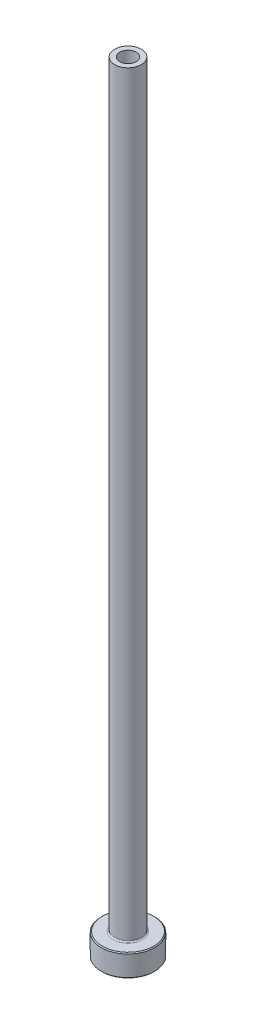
from build123d import *

# Parameters (mm, degrees)
FILLET1_R     = 0.3
CHAMFER1_SIZE = 0.2
CHAMFER3_SIZE = 0.5


with BuildPart() as part:
    # Sketch1 → Revolve1 (revolve)
    with BuildSketch(Plane.XY, mode=Mode.PRIVATE) as revolve1_sk:
        Polygon((-1.85, 175), (-3, 175), (-3, 5), (-6, 5), (-6, 0), (-2.1, 0), (-2.1, 118), (-1.85, 130), align=None)
    revolve(revolve1_sk.sketch.rotate(Axis((0, 92.187680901, 0), (0, -1, 0)), 270), axis=Axis((0, 92.187680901, 0), (0, -1, 0)))

    # Fillet1
    fillet1_edges = [part.edges().sort_by_distance(p)[0] for p in [
        (0, 5, -3),
    ]]
    fillet(fillet1_edges, radius=FILLET1_R)

    # Chamfer1
    chamfer1_edges = [part.edges().sort_by_distance(p)[0] for p in [
        (0, 0, -6),
        (0, 5, -6),
    ]]
    chamfer(chamfer1_edges, length=CHAMFER1_SIZE)

    # Chamfer3
    chamfer3_edges = [part.edges().sort_by_distance(p)[0] for p in [
        (0, 0, -2.1),
    ]]
    chamfer(chamfer3_edges, length=CHAMFER3_SIZE)


solid = part.part
